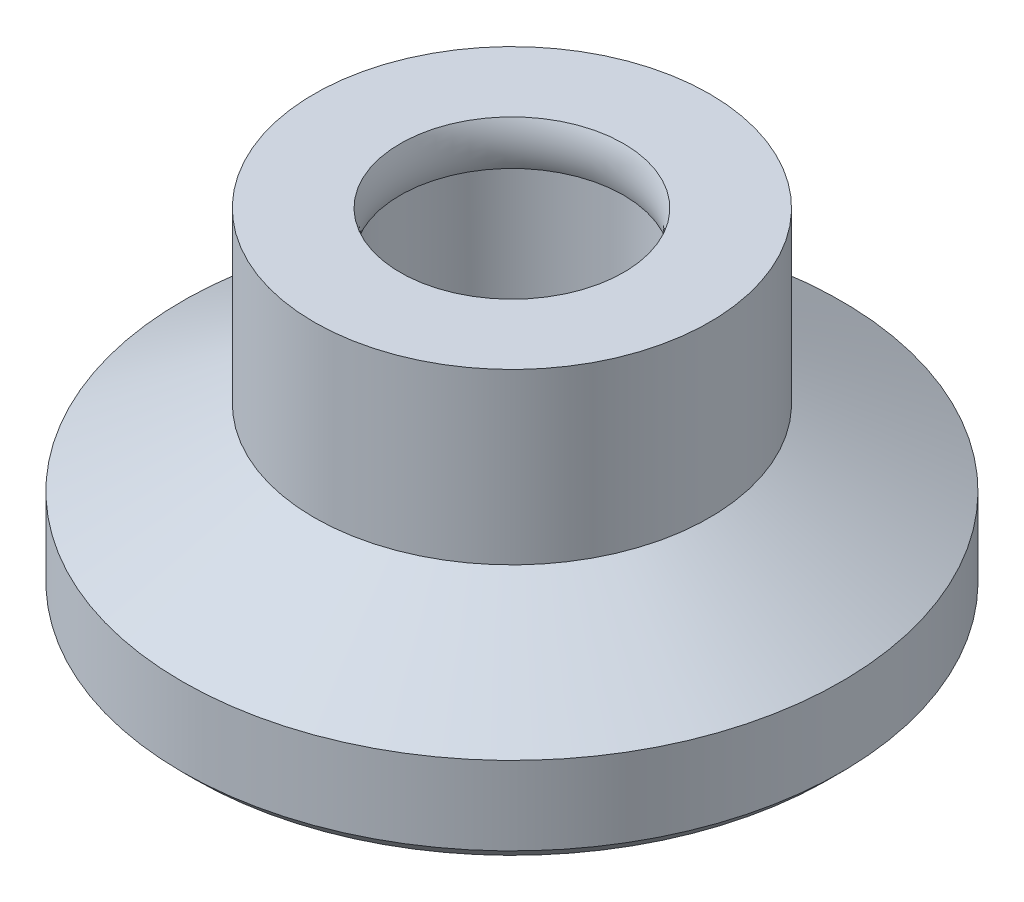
from build123d import *

# Parameters (mm, degrees)
SKETCH1_R      = 5.4
EXTRUDE1_DEPTH = 4.6
SKETCH3_R      = 9
EXTRUDE2_DEPTH = 2.5
CHAMFER1_SIZE  = 0.36


with BuildPart() as part:
    # Sketch1 → Extrude1 (new, symmetric)
    with BuildSketch(Plane(origin=(0, 0, 0), x_dir=(1, 0, 0), z_dir=(0, 1, 0))):
        with Locations(Location((0, 0, 0), (0, 0, 270))):
            Circle(SKETCH1_R)
    extrude(amount=EXTRUDE1_DEPTH, both=True)

    # Sketch3 → Extrude2 (add)
    with BuildSketch(Plane.XZ.offset(4.6)):
        with Locations(Location((0, 0, 0), (0, 0, 270))):
            Circle(SKETCH3_R)
    extrude(amount=-EXTRUDE2_DEPTH)

    # Sketch4 → Revolve1 (revolve)
    with BuildSketch(Plane.XY, mode=Mode.PRIVATE) as revolve1_sk:
        Polygon((-9, -2.1), (-5.4, -0.021539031), (-5.4, -2.1), align=None)
    revolve(revolve1_sk.sketch.rotate(Axis((0, 4.6, 0), (0, -1, 0)), 270), axis=Axis((0, 4.6, 0), (0, -1, 0)))

    # Chamfer1
    chamfer1_edges = [part.edges().sort_by_distance(p)[0] for p in [
        (0, -4.6, 9),
    ]]
    chamfer(chamfer1_edges, length=CHAMFER1_SIZE)

    # Sketch5 → Cut-Revolve1 (revolve, cut)
    with BuildSketch(Plane.XY, mode=Mode.PRIVATE) as cut_revolve1_sk:
        with BuildLine():
            Line((0, 4.6), (3.05, 4.6))
            ThreePointArc((3.05, 4.6), (2.928, 3.99), (3.05, 3.38))
            Line((3.05, 3.38), (3.05, -0.339081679))
            Line((3.05, -0.339081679), (0, -2.1))
            Line((0, -2.1), (0, 4.6))
        make_face()
    revolve(cut_revolve1_sk.sketch.rotate(Axis((0, 0, 0), (0, 1, 0)), 270), axis=Axis((0, 0, 0), (0, 1, 0)), mode=Mode.SUBTRACT)


solid = part.part
